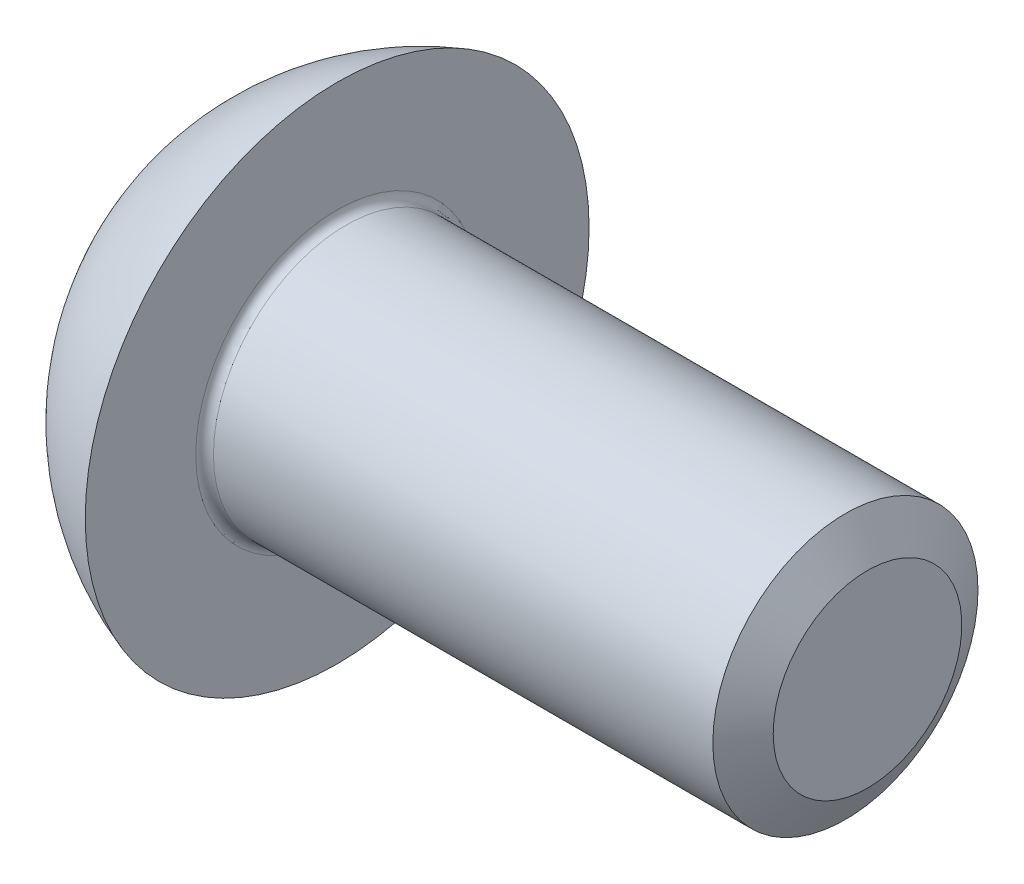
ISO-10303-21;
HEADER;
FILE_DESCRIPTION(('STEP AP214'),'2;1');
FILE_NAME('part.step','',(''),(''),'','','');
FILE_SCHEMA(('AUTOMOTIVE_DESIGN { 1 0 10303 214 1 1 1 1 }'));
ENDSEC;
DATA;
#1=APPLICATION_CONTEXT('core data for automotive mechanical design processes');
#2=APPLICATION_PROTOCOL_DEFINITION('international standard','automotive_design',2000,#1);
#3=PRODUCT_CONTEXT('',#1,'mechanical');
#4=PRODUCT('Part','Part','',(#3));
#5=PRODUCT_RELATED_PRODUCT_CATEGORY('part','',(#4));
#6=PRODUCT_DEFINITION_FORMATION('','',#4);
#7=PRODUCT_DEFINITION_CONTEXT('part definition',#1,'design');
#8=PRODUCT_DEFINITION('design','',#6,#7);
#9=PRODUCT_DEFINITION_SHAPE('','',#8);
#10=(LENGTH_UNIT() NAMED_UNIT(*) SI_UNIT(.MILLI.,.METRE.));
#11=(NAMED_UNIT(*) PLANE_ANGLE_UNIT() SI_UNIT($,.RADIAN.));
#12=(NAMED_UNIT(*) SI_UNIT($,.STERADIAN.) SOLID_ANGLE_UNIT());
#13=UNCERTAINTY_MEASURE_WITH_UNIT(LENGTH_MEASURE(1.E-05),#10,'distance_accuracy_value','');
#14=(GEOMETRIC_REPRESENTATION_CONTEXT(3) GLOBAL_UNCERTAINTY_ASSIGNED_CONTEXT((#13)) GLOBAL_UNIT_ASSIGNED_CONTEXT((#10,
#11,#12)) REPRESENTATION_CONTEXT('',''));
#15=CARTESIAN_POINT('',(0.,0.,0.));
#16=DIRECTION('',(0.,0.,1.));
#17=DIRECTION('',(1.,0.,0.));
#18=AXIS2_PLACEMENT_3D('',#15,#16,#17);
#19=CARTESIAN_POINT('',(-7.65,0.,0.));
#20=DIRECTION('',(-1.,0.,0.));
#21=DIRECTION('',(0.,0.,1.));
#22=AXIS2_PLACEMENT_3D('',#19,#20,#21);
#23=CYLINDRICAL_SURFACE('',#22,1.5);
#24=CARTESIAN_POINT('',(-5.9,0.,0.));
#25=DIRECTION('',(-1.,0.,0.));
#26=DIRECTION('',(0.,0.,1.));
#27=AXIS2_PLACEMENT_3D('',#24,#25,#26);
#28=CIRCLE('',#27,1.5);
#29=CARTESIAN_POINT('',(-5.9,0.,1.5));
#30=VERTEX_POINT('',#29);
#31=EDGE_CURVE('E251',#30,#30,#28,.T.);
#32=ORIENTED_EDGE('',*,*,#31,.F.);
#33=EDGE_LOOP('',(#32));
#34=FACE_BOUND('',#33,.T.);
#35=CARTESIAN_POINT('',(-0.25,0.,0.));
#36=DIRECTION('',(-1.,0.,0.));
#37=DIRECTION('',(0.,0.,1.));
#38=AXIS2_PLACEMENT_3D('',#35,#36,#37);
#39=CIRCLE('',#38,1.5);
#40=CARTESIAN_POINT('',(-0.25,0.,1.5));
#41=VERTEX_POINT('',#40);
#42=EDGE_CURVE('E435',#41,#41,#39,.T.);
#43=ORIENTED_EDGE('',*,*,#42,.T.);
#44=EDGE_LOOP('',(#43));
#45=FACE_BOUND('',#44,.T.);
#46=ADVANCED_FACE('F39',(#34,#45),#23,.T.);
#47=CARTESIAN_POINT('',(-7.65,0.,0.));
#48=DIRECTION('',(1.,0.,0.));
#49=DIRECTION('',(0.,0.,-1.));
#50=AXIS2_PLACEMENT_3D('',#47,#48,#49);
#51=PLANE('',#50);
#52=CARTESIAN_POINT('',(-7.65,0.,0.));
#53=DIRECTION('',(-1.,0.,0.));
#54=DIRECTION('',(0.,0.,1.));
#55=AXIS2_PLACEMENT_3D('',#52,#53,#54);
#56=CIRCLE('',#55,1.5);
#57=CARTESIAN_POINT('',(-7.65,1.5,0.));
#58=VERTEX_POINT('',#57);
#59=EDGE_CURVE('E243',#58,#58,#56,.T.);
#60=ORIENTED_EDGE('',*,*,#59,.T.);
#61=EDGE_LOOP('',(#60));
#62=FACE_BOUND('',#61,.T.);
#63=CARTESIAN_POINT('',(-7.65,0.,0.));
#64=DIRECTION('',(1.,0.,0.));
#65=DIRECTION('',(0.,0.,-1.));
#66=AXIS2_PLACEMENT_3D('',#63,#64,#65);
#67=CIRCLE('',#66,1.15470053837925);
#68=CARTESIAN_POINT('',(-7.65,-0.577350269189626,-1.));
#69=VERTEX_POINT('',#68);
#70=CARTESIAN_POINT('',(-7.65,-1.15470053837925,0.));
#71=VERTEX_POINT('',#70);
#72=EDGE_CURVE('E11',#69,#71,#67,.F.);
#73=ORIENTED_EDGE('',*,*,#72,.F.);
#74=CARTESIAN_POINT('',(-7.65,0.577350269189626,-1.));
#75=VERTEX_POINT('',#74);
#76=EDGE_CURVE('E43',#75,#69,#67,.F.);
#77=ORIENTED_EDGE('',*,*,#76,.F.);
#78=CARTESIAN_POINT('',(-7.65,1.15470053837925,0.));
#79=VERTEX_POINT('',#78);
#80=EDGE_CURVE('E112',#79,#75,#67,.F.);
#81=ORIENTED_EDGE('',*,*,#80,.F.);
#82=CARTESIAN_POINT('',(-7.65,0.,0.));
#83=DIRECTION('',(-1.,0.,0.));
#84=DIRECTION('',(0.,0.,1.));
#85=AXIS2_PLACEMENT_3D('',#82,#83,#84);
#86=CIRCLE('',#85,1.15470053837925);
#87=CARTESIAN_POINT('',(-7.65,0.577350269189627,1.));
#88=VERTEX_POINT('',#87);
#89=EDGE_CURVE('E132',#88,#79,#86,.T.);
#90=ORIENTED_EDGE('',*,*,#89,.F.);
#91=CARTESIAN_POINT('',(-7.65,-0.577350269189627,1.));
#92=VERTEX_POINT('',#91);
#93=EDGE_CURVE('E314',#92,#88,#67,.F.);
#94=ORIENTED_EDGE('',*,*,#93,.F.);
#95=EDGE_CURVE('E48',#71,#92,#67,.F.);
#96=ORIENTED_EDGE('',*,*,#95,.F.);
#97=EDGE_LOOP('',(#73,#77,#81,#90,#94,#96));
#98=FACE_BOUND('',#97,.T.);
#99=ADVANCED_FACE('F41',(#62,#98),#51,.F.);
#100=CARTESIAN_POINT('',(-5.04545454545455,0.,0.));
#101=DIRECTION('',(-1.,0.,0.));
#102=DIRECTION('',(0.,1.,0.));
#103=AXIS2_PLACEMENT_3D('',#100,#101,#102);
#104=SPHERICAL_SURFACE('',#103,3.00560426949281);
#105=CARTESIAN_POINT('',(-6.00000000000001,0.,0.));
#106=DIRECTION('',(-1.,0.,0.));
#107=DIRECTION('',(0.,0.,1.));
#108=AXIS2_PLACEMENT_3D('',#105,#106,#107);
#109=CIRCLE('',#108,2.85);
#110=CARTESIAN_POINT('',(-6.,2.85,0.));
#111=VERTEX_POINT('',#110);
#112=EDGE_CURVE('E246',#111,#111,#109,.T.);
#113=CARTESIAN_POINT('',(-7.65,1.5,0.));
#114=CARTESIAN_POINT('',(-7.6386705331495,1.51967216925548,0.));
#115=CARTESIAN_POINT('',(-7.62711811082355,1.53921593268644,0.));
#116=CARTESIAN_POINT('',(-7.60357346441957,1.57803672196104,0.));
#117=CARTESIAN_POINT('',(-7.59158124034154,1.59731374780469,0.));
#118=CARTESIAN_POINT('',(-7.56716309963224,1.6355911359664,0.));
#119=CARTESIAN_POINT('',(-7.55473718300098,1.65459149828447,0.));
#120=CARTESIAN_POINT('',(-7.52945804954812,1.69230581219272,0.));
#121=CARTESIAN_POINT('',(-7.51660483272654,1.7110197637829,0.));
#122=CARTESIAN_POINT('',(-7.49047769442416,1.74815164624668,0.));
#123=CARTESIAN_POINT('',(-7.47720377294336,1.76656957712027,0.));
#124=CARTESIAN_POINT('',(-7.45024204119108,1.80309996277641,0.));
#125=CARTESIAN_POINT('',(-7.43655423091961,1.82121241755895,0.));
#126=CARTESIAN_POINT('',(-7.40877174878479,1.85712255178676,0.));
#127=CARTESIAN_POINT('',(-7.39467707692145,1.87492023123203,0.));
#128=CARTESIAN_POINT('',(-7.36608810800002,1.91019167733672,0.));
#129=CARTESIAN_POINT('',(-7.35159381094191,1.92766544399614,0.));
#130=CARTESIAN_POINT('',(-7.32221303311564,1.96228009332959,0.));
#131=CARTESIAN_POINT('',(-7.30732655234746,1.97942097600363,0.));
#132=CARTESIAN_POINT('',(-7.27716904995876,2.013361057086,0.));
#133=CARTESIAN_POINT('',(-7.26189802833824,2.03016025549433,0.));
#134=CARTESIAN_POINT('',(-7.2309792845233,2.06340834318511,0.));
#135=CARTESIAN_POINT('',(-7.21533156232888,2.07985723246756,0.));
#136=CARTESIAN_POINT('',(-7.18366745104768,2.11239625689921,0.));
#137=CARTESIAN_POINT('',(-7.16765106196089,2.12848639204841,0.));
#138=CARTESIAN_POINT('',(-7.13525783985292,2.16029964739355,0.));
#139=CARTESIAN_POINT('',(-7.11888100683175,2.17602276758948,0.));
#140=CARTESIAN_POINT('',(-7.08577530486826,2.2070939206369,0.));
#141=CARTESIAN_POINT('',(-7.06904643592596,2.22244195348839,0.));
#142=CARTESIAN_POINT('',(-7.03524525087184,2.25275505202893,0.));
#143=CARTESIAN_POINT('',(-7.01817293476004,2.26772011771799,0.));
#144=CARTESIAN_POINT('',(-6.98369362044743,2.29725959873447,0.));
#145=CARTESIAN_POINT('',(-6.96628662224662,2.3118340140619,0.));
#146=CARTESIAN_POINT('',(-6.93114688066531,2.34058471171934,0.));
#147=CARTESIAN_POINT('',(-6.9134141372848,2.35476099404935,0.));
#148=CARTESIAN_POINT('',(-6.87763200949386,2.38270814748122,0.));
#149=CARTESIAN_POINT('',(-6.85958262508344,2.39647901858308,0.));
#150=CARTESIAN_POINT('',(-6.82317648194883,2.42360827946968,0.));
#151=CARTESIAN_POINT('',(-6.80481972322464,2.43696666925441,0.));
#152=CARTESIAN_POINT('',(-6.76780825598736,2.46326410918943,0.));
#153=CARTESIAN_POINT('',(-6.74915354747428,2.4762031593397,0.));
#154=CARTESIAN_POINT('',(-6.71155575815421,2.50165527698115,0.));
#155=CARTESIAN_POINT('',(-6.69261267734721,2.51416834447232,0.));
#156=CARTESIAN_POINT('',(-6.65444786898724,2.53876207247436,0.));
#157=CARTESIAN_POINT('',(-6.63522614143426,2.55084273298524,0.));
#158=CARTESIAN_POINT('',(-6.59651390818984,2.57456544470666,0.));
#159=CARTESIAN_POINT('',(-6.5770234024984,2.5862074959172,0.));
#160=CARTESIAN_POINT('',(-6.53778361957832,2.60904701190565,0.));
#161=CARTESIAN_POINT('',(-6.51803434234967,2.62024447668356,0.));
#162=CARTESIAN_POINT('',(-6.4782871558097,2.6421890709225,0.));
#163=CARTESIAN_POINT('',(-6.45828924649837,2.65293620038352,0.));
#164=CARTESIAN_POINT('',(-6.41805506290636,2.67397460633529,0.));
#165=CARTESIAN_POINT('',(-6.39781878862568,2.68426588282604,0.));
#166=CARTESIAN_POINT('',(-6.3571182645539,2.70438729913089,0.));
#167=CARTESIAN_POINT('',(-6.3366540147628,2.714217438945,0.));
#168=CARTESIAN_POINT('',(-6.29550804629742,2.73341153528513,0.));
#169=CARTESIAN_POINT('',(-6.27482632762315,2.74277549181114,0.));
#170=CARTESIAN_POINT('',(-6.23325603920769,2.7610324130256,0.));
#171=CARTESIAN_POINT('',(-6.2123674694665,2.76992537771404,0.));
#172=CARTESIAN_POINT('',(-6.17039420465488,2.78723575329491,0.));
#173=CARTESIAN_POINT('',(-6.14930950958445,2.79565316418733,0.));
#174=CARTESIAN_POINT('',(-6.10695481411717,2.81200809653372,0.));
#175=CARTESIAN_POINT('',(-6.08568481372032,2.8199456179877,0.));
#176=CARTESIAN_POINT('',(-6.04297044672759,2.83533674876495,0.));
#177=CARTESIAN_POINT('',(-6.02152608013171,2.84279035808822,0.));
#178=CARTESIAN_POINT('',(-6.,2.85,0.));
#179=B_SPLINE_CURVE_WITH_KNOTS('',3,(#113,#114,#115,#116,#117,#118,#119,#120,#121,#122,#123,
#124,#125,#126,#127,#128,#129,#130,#131,#132,#133,#134,#135,#136,#137,#138,#139,#140,#141,#142,
#143,#144,#145,#146,#147,#148,#149,#150,#151,#152,#153,#154,#155,#156,#157,#158,#159,#160,#161,
#162,#163,#164,#165,#166,#167,#168,#169,#170,#171,#172,#173,#174,#175,#176,#177,#178),
.UNSPECIFIED.,.F.,.F.,(4,2,2,2,2,2,2,2,2,2,2,2,2,2,2,2,2,2,2,2,2,2,2,2,2,2,2,2,2,2,2,2,4),(0.,
0.0681025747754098,0.136205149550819,0.204307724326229,0.272410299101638,0.340512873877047,
0.408615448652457,0.476718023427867,0.544820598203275,0.612923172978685,0.681025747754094,
0.749128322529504,0.817230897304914,0.885333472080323,0.953436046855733,1.02153862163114,
1.08964119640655,1.15774377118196,1.22584634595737,1.29394892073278,1.36205149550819,
1.4301540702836,1.49825664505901,1.56635921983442,1.63446179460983,1.70256436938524,
1.77066694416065,1.83876951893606,1.90687209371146,1.97497466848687,2.04307724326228,
2.11117981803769,2.1792823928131),.UNSPECIFIED.);
#180=EDGE_CURVE('BSEAM232',#58,#111,#179,.T.);
#181=ORIENTED_EDGE('',*,*,#59,.F.);
#182=ORIENTED_EDGE('',*,*,#112,.T.);
#183=ORIENTED_EDGE('',*,*,#180,.T.);
#184=ORIENTED_EDGE('',*,*,#180,.F.);
#185=EDGE_LOOP('',(#181,#183,#182,#184));
#186=FACE_BOUND('',#185,.T.);
#187=ADVANCED_FACE('F232',(#186),#104,.T.);
#188=CARTESIAN_POINT('',(-6.,1.6,0.));
#189=DIRECTION('',(-1.,0.,0.));
#190=DIRECTION('',(0.,0.,1.));
#191=AXIS2_PLACEMENT_3D('',#188,#189,#190);
#192=PLANE('',#191);
#193=ORIENTED_EDGE('',*,*,#112,.F.);
#194=EDGE_LOOP('',(#193));
#195=FACE_BOUND('',#194,.T.);
#196=CARTESIAN_POINT('',(-6.,0.,0.));
#197=DIRECTION('',(-1.,0.,0.));
#198=DIRECTION('',(0.,0.,1.));
#199=AXIS2_PLACEMENT_3D('',#196,#197,#198);
#200=CIRCLE('',#199,1.6);
#201=CARTESIAN_POINT('',(-6.,0.,1.6));
#202=VERTEX_POINT('',#201);
#203=EDGE_CURVE('E247',#202,#202,#200,.T.);
#204=ORIENTED_EDGE('',*,*,#203,.T.);
#205=EDGE_LOOP('',(#204));
#206=FACE_BOUND('',#205,.T.);
#207=ADVANCED_FACE('F229',(#195,#206),#192,.F.);
#208=CARTESIAN_POINT('',(-5.9,0.,0.));
#209=DIRECTION('',(-1.,0.,0.));
#210=DIRECTION('',(0.,0.,1.));
#211=AXIS2_PLACEMENT_3D('',#208,#209,#210);
#212=TOROIDAL_SURFACE('',#211,1.6,0.0999999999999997);
#213=ORIENTED_EDGE('',*,*,#203,.F.);
#214=EDGE_LOOP('',(#213));
#215=FACE_BOUND('',#214,.T.);
#216=ORIENTED_EDGE('',*,*,#31,.T.);
#217=EDGE_LOOP('',(#216));
#218=FACE_BOUND('',#217,.T.);
#219=ADVANCED_FACE('F226',(#215,#218),#212,.F.);
#220=CARTESIAN_POINT('',(-7.35,0.,0.));
#221=DIRECTION('',(-1.,0.,0.));
#222=DIRECTION('',(0.,0.,1.));
#223=AXIS2_PLACEMENT_3D('',#220,#221,#222);
#224=CONICAL_SURFACE('',#223,0.,1.31660847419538);
#225=CARTESIAN_POINT('',(-7.82013380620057,-1.50813004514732,-1.));
#226=CARTESIAN_POINT('',(-7.8103550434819,-1.46296169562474,-1.));
#227=CARTESIAN_POINT('',(-7.80070106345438,-1.41776633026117,-1.));
#228=CARTESIAN_POINT('',(-7.78170572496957,-1.32730802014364,-1.));
#229=CARTESIAN_POINT('',(-7.77236437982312,-1.28204507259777,-1.));
#230=CARTESIAN_POINT('',(-7.74488770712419,-1.14605409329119,-1.));
#231=CARTESIAN_POINT('',(-7.72731859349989,-1.05520983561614,-1.));
#232=CARTESIAN_POINT('',(-7.69461131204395,-0.873838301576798,-1.));
#233=CARTESIAN_POINT('',(-7.67945456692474,-0.7833144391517,-1.));
#234=CARTESIAN_POINT('',(-7.6526000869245,-0.6017545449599,-1.));
#235=CARTESIAN_POINT('',(-7.64090169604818,-0.510718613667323,-1.));
#236=CARTESIAN_POINT('',(-7.62246881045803,-0.327147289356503,-1.));
#237=CARTESIAN_POINT('',(-7.61578776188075,-0.234606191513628,-1.));
#238=CARTESIAN_POINT('',(-7.60903683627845,-0.0493046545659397,-1.));
#239=CARTESIAN_POINT('',(-7.60896400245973,0.0434556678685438,-1.));
#240=CARTESIAN_POINT('',(-7.61545349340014,0.229083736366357,-1.));
#241=CARTESIAN_POINT('',(-7.62204147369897,0.321950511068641,-1.));
#242=CARTESIAN_POINT('',(-7.64045721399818,0.507192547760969,-1.));
#243=CARTESIAN_POINT('',(-7.65228848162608,0.599567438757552,-1.));
#244=CARTESIAN_POINT('',(-7.67981183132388,0.785811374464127,-1.));
#245=CARTESIAN_POINT('',(-7.69558360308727,0.879668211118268,-1.));
#246=CARTESIAN_POINT('',(-7.72952329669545,1.06695285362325,-1.));
#247=CARTESIAN_POINT('',(-7.74769157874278,1.1603805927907,-1.));
#248=CARTESIAN_POINT('',(-7.78558531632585,1.34694314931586,-1.));
#249=CARTESIAN_POINT('',(-7.80531120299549,1.44007787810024,-1.));
#250=CARTESIAN_POINT('',(-7.84579713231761,1.62612272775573,-1.));
#251=CARTESIAN_POINT('',(-7.86655719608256,1.71903284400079,-1.));
#252=CARTESIAN_POINT('',(-7.90854857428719,1.903637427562,-1.));
#253=CARTESIAN_POINT('',(-7.92977186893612,1.9953337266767,-1.));
#254=CARTESIAN_POINT('',(-7.97271430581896,2.17861191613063,-1.));
#255=CARTESIAN_POINT('',(-7.99443345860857,2.27019380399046,-1.));
#256=CARTESIAN_POINT('',(-8.03820424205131,2.45314970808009,-1.));
#257=CARTESIAN_POINT('',(-8.06025539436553,2.5445238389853,-1.));
#258=CARTESIAN_POINT('',(-8.10463324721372,2.72720190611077,-1.));
#259=CARTESIAN_POINT('',(-8.12695993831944,2.8185058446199,-1.));
#260=CARTESIAN_POINT('',(-8.14938266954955,2.90978592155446,-1.));
#261=B_SPLINE_CURVE_WITH_KNOTS('',3,(#225,#226,#227,#228,#229,#230,#231,#232,#233,#234,#235,
#236,#237,#238,#239,#240,#241,#242,#243,#244,#245,#246,#247,#248,#249,#250,#251,#252,#253,#254,
#255,#256,#257,#258,#259,#260),.UNSPECIFIED.,.F.,.F.,(4,2,2,2,2,2,2,2,2,2,2,2,2,2,2,2,2,4),(0.,
0.138643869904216,0.27729363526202,0.554857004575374,0.830167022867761,1.1054247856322,
1.38357462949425,1.66160001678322,1.94070037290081,2.2199877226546,2.50545939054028,
2.79097401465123,3.07656794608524,3.36216771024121,3.64452690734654,3.92689212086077,
4.20888343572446,4.49086512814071),.UNSPECIFIED.);
#262=EDGE_CURVE('E103',#69,#75,#261,.T.);
#263=ORIENTED_EDGE('',*,*,#262,.T.);
#264=ORIENTED_EDGE('',*,*,#76,.T.);
#265=EDGE_LOOP('',(#263,#264));
#266=FACE_BOUND('',#265,.T.);
#267=ADVANCED_FACE('F107',(#266),#224,.F.);
#268=CARTESIAN_POINT('',(-7.65003000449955,0.577234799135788,-1.0002));
#269=CARTESIAN_POINT('',(-7.64379291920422,0.6012250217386,-0.958647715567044));
#270=CARTESIAN_POINT('',(-7.63813137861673,0.625256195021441,-0.917024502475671));
#271=CARTESIAN_POINT('',(-7.62818542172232,0.673398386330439,-0.833639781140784));
#272=CARTESIAN_POINT('',(-7.6239015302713,0.697509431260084,-0.791878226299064));
#273=CARTESIAN_POINT('',(-7.61695890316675,0.745673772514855,-0.708455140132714));
#274=CARTESIAN_POINT('',(-7.6142923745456,0.769726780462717,-0.666794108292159));
#275=CARTESIAN_POINT('',(-7.61071689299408,0.817861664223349,-0.583422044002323));
#276=CARTESIAN_POINT('',(-7.60980762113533,0.841943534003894,-0.541711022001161));
#277=CARTESIAN_POINT('',(-7.60980762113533,0.890107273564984,-0.458288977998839));
#278=CARTESIAN_POINT('',(-7.61071689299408,0.914189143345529,-0.416577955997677));
#279=CARTESIAN_POINT('',(-7.6142923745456,0.962324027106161,-0.333205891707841));
#280=CARTESIAN_POINT('',(-7.61695890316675,0.986377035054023,-0.291544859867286));
#281=CARTESIAN_POINT('',(-7.6239015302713,1.03454137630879,-0.208121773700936));
#282=CARTESIAN_POINT('',(-7.62818542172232,1.05865242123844,-0.166360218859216));
#283=CARTESIAN_POINT('',(-7.63813137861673,1.10679461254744,-0.0829754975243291));
#284=CARTESIAN_POINT('',(-7.64379291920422,1.13082578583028,-0.0413522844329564));
#285=CARTESIAN_POINT('',(-7.65003000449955,1.15481600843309,0.000199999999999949));
#286=B_SPLINE_CURVE_WITH_KNOTS('',3,(#268,#269,#270,#271,#272,#273,#274,#275,#276,#277,#278,
#279,#280,#281,#282,#283,#284,#285),.UNSPECIFIED.,.F.,.F.,(4,2,2,2,2,2,2,2,4),(0.,
0.145159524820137,0.290374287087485,0.434883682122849,0.57936684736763,0.723850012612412,
0.868359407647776,1.01357416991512,1.15873369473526),.UNSPECIFIED.);
#287=EDGE_CURVE('E130',#75,#79,#286,.T.);
#288=ORIENTED_EDGE('',*,*,#287,.T.);
#289=ORIENTED_EDGE('',*,*,#80,.T.);
#290=EDGE_LOOP('',(#288,#289));
#291=FACE_BOUND('',#290,.T.);
#292=ADVANCED_FACE('F156',(#291),#224,.F.);
#293=CARTESIAN_POINT('',(-7.65003000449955,1.15481600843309,-0.000199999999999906));
#294=CARTESIAN_POINT('',(-7.64379291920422,1.13082578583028,0.0413522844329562));
#295=CARTESIAN_POINT('',(-7.63813137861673,1.10679461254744,0.0829754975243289));
#296=CARTESIAN_POINT('',(-7.62818542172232,1.05865242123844,0.166360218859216));
#297=CARTESIAN_POINT('',(-7.6239015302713,1.03454137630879,0.208121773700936));
#298=CARTESIAN_POINT('',(-7.61695890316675,0.986377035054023,0.291544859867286));
#299=CARTESIAN_POINT('',(-7.6142923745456,0.962324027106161,0.333205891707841));
#300=CARTESIAN_POINT('',(-7.61071689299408,0.914189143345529,0.416577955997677));
#301=CARTESIAN_POINT('',(-7.60980762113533,0.890107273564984,0.458288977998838));
#302=CARTESIAN_POINT('',(-7.60980762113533,0.841943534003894,0.541711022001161));
#303=CARTESIAN_POINT('',(-7.61071689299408,0.817861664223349,0.583422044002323));
#304=CARTESIAN_POINT('',(-7.6142923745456,0.769726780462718,0.666794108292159));
#305=CARTESIAN_POINT('',(-7.61695890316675,0.745673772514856,0.708455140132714));
#306=CARTESIAN_POINT('',(-7.6239015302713,0.697509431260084,0.791878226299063));
#307=CARTESIAN_POINT('',(-7.62818542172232,0.67339838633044,0.833639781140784));
#308=CARTESIAN_POINT('',(-7.63813137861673,0.625256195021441,0.917024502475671));
#309=CARTESIAN_POINT('',(-7.64379291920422,0.6012250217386,0.958647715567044));
#310=CARTESIAN_POINT('',(-7.65003000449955,0.577234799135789,1.0002));
#311=B_SPLINE_CURVE_WITH_KNOTS('',3,(#293,#294,#295,#296,#297,#298,#299,#300,#301,#302,#303,
#304,#305,#306,#307,#308,#309,#310),.UNSPECIFIED.,.F.,.F.,(4,2,2,2,2,2,2,2,4),(0.,
0.145159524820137,0.290374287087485,0.434883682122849,0.57936684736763,0.723850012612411,
0.868359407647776,1.01357416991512,1.15873369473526),.UNSPECIFIED.);
#312=EDGE_CURVE('E176',#79,#88,#311,.T.);
#313=ORIENTED_EDGE('',*,*,#312,.T.);
#314=ORIENTED_EDGE('',*,*,#89,.T.);
#315=EDGE_LOOP('',(#313,#314));
#316=FACE_BOUND('',#315,.T.);
#317=ADVANCED_FACE('F150',(#316),#224,.F.);
#318=CARTESIAN_POINT('',(-7.82013380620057,-1.50813004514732,1.));
#319=CARTESIAN_POINT('',(-7.8103550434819,-1.46296169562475,1.));
#320=CARTESIAN_POINT('',(-7.80070106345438,-1.41776633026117,1.));
#321=CARTESIAN_POINT('',(-7.78170572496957,-1.32730802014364,1.));
#322=CARTESIAN_POINT('',(-7.77236437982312,-1.28204507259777,1.));
#323=CARTESIAN_POINT('',(-7.74488770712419,-1.14605409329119,1.));
#324=CARTESIAN_POINT('',(-7.72731859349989,-1.05520983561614,1.));
#325=CARTESIAN_POINT('',(-7.69461131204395,-0.873838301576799,1.));
#326=CARTESIAN_POINT('',(-7.67945456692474,-0.783314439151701,1.));
#327=CARTESIAN_POINT('',(-7.6526000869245,-0.601754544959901,1.));
#328=CARTESIAN_POINT('',(-7.64090169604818,-0.510718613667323,1.));
#329=CARTESIAN_POINT('',(-7.62246881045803,-0.327147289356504,1.));
#330=CARTESIAN_POINT('',(-7.61578776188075,-0.234606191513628,1.));
#331=CARTESIAN_POINT('',(-7.60903683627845,-0.0493046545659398,1.));
#332=CARTESIAN_POINT('',(-7.60896400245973,0.0434556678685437,1.));
#333=CARTESIAN_POINT('',(-7.61545349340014,0.229083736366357,1.));
#334=CARTESIAN_POINT('',(-7.62204147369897,0.321950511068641,1.));
#335=CARTESIAN_POINT('',(-7.64045721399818,0.507192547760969,1.));
#336=CARTESIAN_POINT('',(-7.65228848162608,0.599567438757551,1.));
#337=CARTESIAN_POINT('',(-7.67981183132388,0.785811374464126,1.));
#338=CARTESIAN_POINT('',(-7.69558360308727,0.879668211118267,1.));
#339=CARTESIAN_POINT('',(-7.72952329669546,1.06695285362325,1.));
#340=CARTESIAN_POINT('',(-7.74769157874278,1.1603805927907,0.999999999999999));
#341=CARTESIAN_POINT('',(-7.78558531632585,1.34694314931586,0.999999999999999));
#342=CARTESIAN_POINT('',(-7.80531120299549,1.44007787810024,0.999999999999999));
#343=CARTESIAN_POINT('',(-7.84579713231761,1.62612272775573,0.999999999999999));
#344=CARTESIAN_POINT('',(-7.86655719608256,1.71903284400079,0.999999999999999));
#345=CARTESIAN_POINT('',(-7.90854857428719,1.903637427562,0.999999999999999));
#346=CARTESIAN_POINT('',(-7.92977186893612,1.9953337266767,0.999999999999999));
#347=CARTESIAN_POINT('',(-7.97271430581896,2.17861191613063,0.999999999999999));
#348=CARTESIAN_POINT('',(-7.99443345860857,2.27019380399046,0.999999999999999));
#349=CARTESIAN_POINT('',(-8.03820424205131,2.45314970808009,0.999999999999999));
#350=CARTESIAN_POINT('',(-8.06025539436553,2.5445238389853,0.999999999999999));
#351=CARTESIAN_POINT('',(-8.10463324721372,2.72720190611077,0.999999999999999));
#352=CARTESIAN_POINT('',(-8.12695993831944,2.81850584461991,0.999999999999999));
#353=CARTESIAN_POINT('',(-8.14938266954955,2.90978592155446,0.999999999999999));
#354=B_SPLINE_CURVE_WITH_KNOTS('',3,(#318,#319,#320,#321,#322,#323,#324,#325,#326,#327,#328,
#329,#330,#331,#332,#333,#334,#335,#336,#337,#338,#339,#340,#341,#342,#343,#344,#345,#346,#347,
#348,#349,#350,#351,#352,#353),.UNSPECIFIED.,.F.,.F.,(4,2,2,2,2,2,2,2,2,2,2,2,2,2,2,2,2,4),(0.,
0.138643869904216,0.27729363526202,0.554857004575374,0.83016702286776,1.1054247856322,
1.38357462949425,1.66160001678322,1.94070037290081,2.2199877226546,2.50545939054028,
2.79097401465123,3.07656794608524,3.36216771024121,3.64452690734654,3.92689212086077,
4.20888343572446,4.49086512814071),.UNSPECIFIED.);
#355=EDGE_CURVE('E60',#88,#92,#354,.F.);
#356=ORIENTED_EDGE('',*,*,#355,.T.);
#357=ORIENTED_EDGE('',*,*,#93,.T.);
#358=EDGE_LOOP('',(#356,#357));
#359=FACE_BOUND('',#358,.T.);
#360=ADVANCED_FACE('F155',(#359),#224,.F.);
#361=CARTESIAN_POINT('',(-7.65003000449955,-0.577234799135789,1.0002));
#362=CARTESIAN_POINT('',(-7.64379291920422,-0.6012250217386,0.958647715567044));
#363=CARTESIAN_POINT('',(-7.63813137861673,-0.625256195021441,0.917024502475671));
#364=CARTESIAN_POINT('',(-7.62818542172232,-0.67339838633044,0.833639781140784));
#365=CARTESIAN_POINT('',(-7.6239015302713,-0.697509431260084,0.791878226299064));
#366=CARTESIAN_POINT('',(-7.61695890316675,-0.745673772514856,0.708455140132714));
#367=CARTESIAN_POINT('',(-7.6142923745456,-0.769726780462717,0.666794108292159));
#368=CARTESIAN_POINT('',(-7.61071689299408,-0.817861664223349,0.583422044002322));
#369=CARTESIAN_POINT('',(-7.60980762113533,-0.841943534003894,0.541711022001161));
#370=CARTESIAN_POINT('',(-7.60980762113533,-0.890107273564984,0.458288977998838));
#371=CARTESIAN_POINT('',(-7.61071689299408,-0.914189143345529,0.416577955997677));
#372=CARTESIAN_POINT('',(-7.6142923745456,-0.962324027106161,0.333205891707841));
#373=CARTESIAN_POINT('',(-7.61695890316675,-0.986377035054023,0.291544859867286));
#374=CARTESIAN_POINT('',(-7.6239015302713,-1.03454137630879,0.208121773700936));
#375=CARTESIAN_POINT('',(-7.62818542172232,-1.05865242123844,0.166360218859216));
#376=CARTESIAN_POINT('',(-7.63813137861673,-1.10679461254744,0.0829754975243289));
#377=CARTESIAN_POINT('',(-7.64379291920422,-1.13082578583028,0.0413522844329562));
#378=CARTESIAN_POINT('',(-7.65003000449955,-1.15481600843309,-0.000200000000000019));
#379=B_SPLINE_CURVE_WITH_KNOTS('',3,(#361,#362,#363,#364,#365,#366,#367,#368,#369,#370,#371,
#372,#373,#374,#375,#376,#377,#378),.UNSPECIFIED.,.F.,.F.,(4,2,2,2,2,2,2,2,4),(0.,
0.145159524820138,0.290374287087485,0.43488368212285,0.579366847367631,0.723850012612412,
0.868359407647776,1.01357416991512,1.15873369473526),.UNSPECIFIED.);
#380=EDGE_CURVE('E54',#92,#71,#379,.T.);
#381=ORIENTED_EDGE('',*,*,#380,.T.);
#382=ORIENTED_EDGE('',*,*,#95,.T.);
#383=EDGE_LOOP('',(#381,#382));
#384=FACE_BOUND('',#383,.T.);
#385=ADVANCED_FACE('F300',(#384),#224,.F.);
#386=CARTESIAN_POINT('',(-7.65003000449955,-1.15481600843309,0.000199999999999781));
#387=CARTESIAN_POINT('',(-7.64379291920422,-1.13082578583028,-0.0413522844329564));
#388=CARTESIAN_POINT('',(-7.63813137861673,-1.10679461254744,-0.0829754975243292));
#389=CARTESIAN_POINT('',(-7.62818542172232,-1.05865242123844,-0.166360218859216));
#390=CARTESIAN_POINT('',(-7.6239015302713,-1.03454137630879,-0.208121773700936));
#391=CARTESIAN_POINT('',(-7.61695890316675,-0.986377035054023,-0.291544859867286));
#392=CARTESIAN_POINT('',(-7.6142923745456,-0.962324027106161,-0.333205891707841));
#393=CARTESIAN_POINT('',(-7.61071689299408,-0.914189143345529,-0.416577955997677));
#394=CARTESIAN_POINT('',(-7.60980762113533,-0.890107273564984,-0.458288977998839));
#395=CARTESIAN_POINT('',(-7.60980762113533,-0.841943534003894,-0.541711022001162));
#396=CARTESIAN_POINT('',(-7.61071689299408,-0.817861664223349,-0.583422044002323));
#397=CARTESIAN_POINT('',(-7.6142923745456,-0.769726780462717,-0.66679410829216));
#398=CARTESIAN_POINT('',(-7.61695890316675,-0.745673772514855,-0.708455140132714));
#399=CARTESIAN_POINT('',(-7.6239015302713,-0.697509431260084,-0.791878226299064));
#400=CARTESIAN_POINT('',(-7.62818542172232,-0.673398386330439,-0.833639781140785));
#401=CARTESIAN_POINT('',(-7.63813137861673,-0.62525619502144,-0.917024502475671));
#402=CARTESIAN_POINT('',(-7.64379291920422,-0.601225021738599,-0.958647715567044));
#403=CARTESIAN_POINT('',(-7.65003000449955,-0.577234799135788,-1.0002));
#404=B_SPLINE_CURVE_WITH_KNOTS('',3,(#386,#387,#388,#389,#390,#391,#392,#393,#394,#395,#396,
#397,#398,#399,#400,#401,#402,#403),.UNSPECIFIED.,.F.,.F.,(4,2,2,2,2,2,2,2,4),(0.,
0.145159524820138,0.290374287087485,0.43488368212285,0.579366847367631,0.723850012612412,
0.868359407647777,1.01357416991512,1.15873369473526),.UNSPECIFIED.);
#405=EDGE_CURVE('E95',#71,#69,#404,.T.);
#406=ORIENTED_EDGE('',*,*,#405,.T.);
#407=ORIENTED_EDGE('',*,*,#72,.T.);
#408=EDGE_LOOP('',(#406,#407));
#409=FACE_BOUND('',#408,.T.);
#410=ADVANCED_FACE('F97',(#409),#224,.F.);
#411=CARTESIAN_POINT('',(-6.61,0.,0.));
#412=DIRECTION('',(-1.,0.,0.));
#413=DIRECTION('',(0.,0.,1.));
#414=AXIS2_PLACEMENT_3D('',#411,#412,#413);
#415=CONICAL_SURFACE('',#414,1.15470053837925,1.08478502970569);
#416=CARTESIAN_POINT('',(-6.00000000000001,0.,0.));
#417=VERTEX_POINT('',#416);
#418=VERTEX_LOOP('',#417);
#419=FACE_BOUND('',#418,.T.);
#420=CARTESIAN_POINT('',(-6.95337776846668,-1.50230992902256,1.));
#421=CARTESIAN_POINT('',(-6.93404447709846,-1.45833854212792,1.));
#422=CARTESIAN_POINT('',(-6.91492324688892,-1.41427434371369,1.));
#423=CARTESIAN_POINT('',(-6.87721630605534,-1.32590919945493,1.));
#424=CARTESIAN_POINT('',(-6.85863068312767,-1.28160821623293,1.));
#425=CARTESIAN_POINT('',(-6.80366814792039,-1.14784319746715,1.));
#426=CARTESIAN_POINT('',(-6.76828448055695,-1.0579632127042,1.));
#427=CARTESIAN_POINT('',(-6.7014887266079,-0.876123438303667,1.));
#428=CARTESIAN_POINT('',(-6.67010099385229,-0.784154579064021,1.));
#429=CARTESIAN_POINT('',(-6.61426989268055,-0.598229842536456,1.));
#430=CARTESIAN_POINT('',(-6.58981126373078,-0.504278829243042,1.));
#431=CARTESIAN_POINT('',(-6.56128421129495,-0.361662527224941,1.));
#432=CARTESIAN_POINT('',(-6.55313365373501,-0.313821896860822,1.));
#433=CARTESIAN_POINT('',(-6.54009013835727,-0.217683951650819,1.));
#434=CARTESIAN_POINT('',(-6.53519738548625,-0.169386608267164,1.));
#435=CARTESIAN_POINT('',(-6.52906892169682,-0.0727543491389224,1.));
#436=CARTESIAN_POINT('',(-6.52781819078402,-0.024420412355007,1.));
#437=CARTESIAN_POINT('',(-6.52903404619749,0.0721832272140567,1.));
#438=CARTESIAN_POINT('',(-6.53149961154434,0.120452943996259,1.));
#439=CARTESIAN_POINT('',(-6.54268581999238,0.247728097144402,1.));
#440=CARTESIAN_POINT('',(-6.55441562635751,0.326472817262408,1.));
#441=CARTESIAN_POINT('',(-6.5853155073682,0.48261102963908,1.));
#442=CARTESIAN_POINT('',(-6.60450541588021,0.560000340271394,1.));
#443=CARTESIAN_POINT('',(-6.64844209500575,0.714868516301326,1.));
#444=CARTESIAN_POINT('',(-6.67329514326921,0.792316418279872,1.));
#445=CARTESIAN_POINT('',(-6.71314935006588,0.907307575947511,1.));
#446=CARTESIAN_POINT('',(-6.72681730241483,0.94532619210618,1.));
#447=CARTESIAN_POINT('',(-6.75487650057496,1.02108213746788,1.));
#448=CARTESIAN_POINT('',(-6.76926751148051,1.05881955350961,1.));
#449=CARTESIAN_POINT('',(-6.78394894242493,1.09644387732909,1.));
#450=B_SPLINE_CURVE_WITH_KNOTS('',3,(#420,#421,#422,#423,#424,#425,#426,#427,#428,#429,#430,
#431,#432,#433,#434,#435,#436,#437,#438,#439,#440,#441,#442,#443,#444,#445,#446,#447,#448,#449),
.UNSPECIFIED.,.F.,.F.,(4,2,2,2,2,2,2,2,2,2,2,2,2,2,4),(0.,0.144099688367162,0.288222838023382,
0.577934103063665,0.869334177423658,1.16008739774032,1.30558498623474,1.45109172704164,
1.59599753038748,1.74086353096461,1.97918577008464,2.21814600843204,2.46202630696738,
2.58322416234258,2.70438289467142),.UNSPECIFIED.);
#451=CARTESIAN_POINT('',(-6.61,-0.577350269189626,1.));
#452=VERTEX_POINT('',#451);
#453=CARTESIAN_POINT('',(-6.61,0.577350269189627,1.));
#454=VERTEX_POINT('',#453);
#455=EDGE_CURVE('E191',#452,#454,#450,.T.);
#456=ORIENTED_EDGE('',*,*,#455,.T.);
#457=CARTESIAN_POINT('',(-6.61006100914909,0.577234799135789,1.0002));
#458=CARTESIAN_POINT('',(-6.59674716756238,0.602421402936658,0.956575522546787));
#459=CARTESIAN_POINT('',(-6.58464843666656,0.627789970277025,0.912635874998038));
#460=CARTESIAN_POINT('',(-6.56351592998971,0.678892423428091,0.824123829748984));
#461=CARTESIAN_POINT('',(-6.55448814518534,0.704626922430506,0.77955036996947));
#462=CARTESIAN_POINT('',(-6.54033689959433,0.755829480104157,0.690864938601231));
#463=CARTESIAN_POINT('',(-6.53513654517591,0.781292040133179,0.646762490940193));
#464=CARTESIAN_POINT('',(-6.52879891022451,0.8323219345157,0.558376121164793));
#465=CARTESIAN_POINT('',(-6.52765764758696,0.85788914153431,0.514092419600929));
#466=CARTESIAN_POINT('',(-6.52942932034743,0.906140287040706,0.430518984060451));
#467=CARTESIAN_POINT('',(-6.53190541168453,0.92882859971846,0.391221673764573));
#468=CARTESIAN_POINT('',(-6.53995672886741,0.974082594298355,0.312839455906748));
#469=CARTESIAN_POINT('',(-6.54553433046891,0.996648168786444,0.273754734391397));
#470=CARTESIAN_POINT('',(-6.55955566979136,1.04198502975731,0.195228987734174));
#471=CARTESIAN_POINT('',(-6.56805139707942,1.06475218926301,0.155795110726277));
#472=CARTESIAN_POINT('',(-6.58740312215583,1.1099976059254,0.0774277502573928));
#473=CARTESIAN_POINT('',(-6.59825526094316,1.13247627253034,0.0384935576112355));
#474=CARTESIAN_POINT('',(-6.61006100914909,1.15481600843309,-0.000199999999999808));
#475=B_SPLINE_CURVE_WITH_KNOTS('',3,(#457,#458,#459,#460,#461,#462,#463,#464,#465,#466,#467,
#468,#469,#470,#471,#472,#473,#474),.UNSPECIFIED.,.F.,.F.,(4,2,2,2,2,2,2,2,4),(0.,
0.156356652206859,0.313016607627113,0.466436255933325,0.619705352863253,0.755925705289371,
0.892250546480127,1.03114227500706,1.16980823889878),.UNSPECIFIED.);
#476=CARTESIAN_POINT('',(-6.61,1.15470053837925,0.));
#477=VERTEX_POINT('',#476);
#478=EDGE_CURVE('E198',#454,#477,#475,.T.);
#479=ORIENTED_EDGE('',*,*,#478,.T.);
#480=CARTESIAN_POINT('',(-6.61006100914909,1.15481600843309,0.000200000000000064));
#481=CARTESIAN_POINT('',(-6.59674716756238,1.12962940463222,-0.0434244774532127));
#482=CARTESIAN_POINT('',(-6.58464843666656,1.10426083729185,-0.0873641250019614));
#483=CARTESIAN_POINT('',(-6.56351592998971,1.05315838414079,-0.175876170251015));
#484=CARTESIAN_POINT('',(-6.55448814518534,1.02742388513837,-0.220449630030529));
#485=CARTESIAN_POINT('',(-6.54033689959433,0.976221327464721,-0.309135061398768));
#486=CARTESIAN_POINT('',(-6.53513654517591,0.9507587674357,-0.353237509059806));
#487=CARTESIAN_POINT('',(-6.52879891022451,0.899728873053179,-0.441623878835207));
#488=CARTESIAN_POINT('',(-6.52765764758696,0.874161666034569,-0.485907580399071));
#489=CARTESIAN_POINT('',(-6.52942932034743,0.825910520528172,-0.569481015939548));
#490=CARTESIAN_POINT('',(-6.53190541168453,0.803222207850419,-0.608778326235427));
#491=CARTESIAN_POINT('',(-6.53995672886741,0.757968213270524,-0.687160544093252));
#492=CARTESIAN_POINT('',(-6.54553433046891,0.735402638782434,-0.726245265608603));
#493=CARTESIAN_POINT('',(-6.55955566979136,0.69006577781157,-0.804771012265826));
#494=CARTESIAN_POINT('',(-6.56805139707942,0.66729861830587,-0.844204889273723));
#495=CARTESIAN_POINT('',(-6.58740312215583,0.622053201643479,-0.922572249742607));
#496=CARTESIAN_POINT('',(-6.59825526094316,0.59957453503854,-0.961506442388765));
#497=CARTESIAN_POINT('',(-6.61006100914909,0.577234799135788,-1.0002));
#498=B_SPLINE_CURVE_WITH_KNOTS('',3,(#480,#481,#482,#483,#484,#485,#486,#487,#488,#489,#490,
#491,#492,#493,#494,#495,#496,#497),.UNSPECIFIED.,.F.,.F.,(4,2,2,2,2,2,2,2,4),(0.,
0.156356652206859,0.313016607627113,0.466436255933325,0.619705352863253,0.755925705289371,
0.892250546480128,1.03114227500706,1.16980823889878),.UNSPECIFIED.);
#499=CARTESIAN_POINT('',(-6.61,0.577350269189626,-1.));
#500=VERTEX_POINT('',#499);
#501=EDGE_CURVE('E113',#477,#500,#498,.T.);
#502=ORIENTED_EDGE('',*,*,#501,.T.);
#503=CARTESIAN_POINT('',(-6.95337776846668,-1.50230992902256,-1.));
#504=CARTESIAN_POINT('',(-6.93404447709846,-1.45833854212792,-1.));
#505=CARTESIAN_POINT('',(-6.91492324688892,-1.41427434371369,-1.));
#506=CARTESIAN_POINT('',(-6.87721630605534,-1.32590919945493,-1.));
#507=CARTESIAN_POINT('',(-6.85863068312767,-1.28160821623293,-1.));
#508=CARTESIAN_POINT('',(-6.80366814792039,-1.14784319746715,-1.));
#509=CARTESIAN_POINT('',(-6.76828448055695,-1.0579632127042,-1.));
#510=CARTESIAN_POINT('',(-6.7014887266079,-0.876123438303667,-1.));
#511=CARTESIAN_POINT('',(-6.67010099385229,-0.784154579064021,-1.));
#512=CARTESIAN_POINT('',(-6.61426989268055,-0.598229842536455,-1.));
#513=CARTESIAN_POINT('',(-6.58981126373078,-0.504278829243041,-1.));
#514=CARTESIAN_POINT('',(-6.56128421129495,-0.36166252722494,-1.));
#515=CARTESIAN_POINT('',(-6.55313365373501,-0.313821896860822,-1.));
#516=CARTESIAN_POINT('',(-6.54009013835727,-0.217683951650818,-1.));
#517=CARTESIAN_POINT('',(-6.53519738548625,-0.169386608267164,-1.));
#518=CARTESIAN_POINT('',(-6.52906892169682,-0.072754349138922,-1.));
#519=CARTESIAN_POINT('',(-6.52781819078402,-0.0244204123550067,-1.));
#520=CARTESIAN_POINT('',(-6.52903404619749,0.072183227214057,-1.));
#521=CARTESIAN_POINT('',(-6.53149961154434,0.120452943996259,-1.));
#522=CARTESIAN_POINT('',(-6.54268581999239,0.247728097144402,-1.));
#523=CARTESIAN_POINT('',(-6.55441562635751,0.326472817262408,-1.));
#524=CARTESIAN_POINT('',(-6.5853155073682,0.482611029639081,-1.));
#525=CARTESIAN_POINT('',(-6.60450541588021,0.560000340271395,-1.));
#526=CARTESIAN_POINT('',(-6.64844209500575,0.714868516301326,-1.));
#527=CARTESIAN_POINT('',(-6.67329514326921,0.792316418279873,-1.));
#528=CARTESIAN_POINT('',(-6.71314935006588,0.907307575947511,-1.));
#529=CARTESIAN_POINT('',(-6.72681730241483,0.945326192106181,-1.));
#530=CARTESIAN_POINT('',(-6.75487650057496,1.02108213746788,-1.));
#531=CARTESIAN_POINT('',(-6.76926751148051,1.05881955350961,-1.));
#532=CARTESIAN_POINT('',(-6.78394894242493,1.09644387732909,-1.));
#533=B_SPLINE_CURVE_WITH_KNOTS('',3,(#503,#504,#505,#506,#507,#508,#509,#510,#511,#512,#513,
#514,#515,#516,#517,#518,#519,#520,#521,#522,#523,#524,#525,#526,#527,#528,#529,#530,#531,#532),
.UNSPECIFIED.,.F.,.F.,(4,2,2,2,2,2,2,2,2,2,2,2,2,2,4),(0.,0.144099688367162,0.288222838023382,
0.577934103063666,0.869334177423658,1.16008739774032,1.30558498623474,1.45109172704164,
1.59599753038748,1.74086353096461,1.97918577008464,2.21814600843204,2.46202630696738,
2.58322416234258,2.70438289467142),.UNSPECIFIED.);
#534=CARTESIAN_POINT('',(-6.61,-0.577350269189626,-1.));
#535=VERTEX_POINT('',#534);
#536=EDGE_CURVE('E259',#500,#535,#533,.F.);
#537=ORIENTED_EDGE('',*,*,#536,.T.);
#538=CARTESIAN_POINT('',(-6.61006100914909,-0.577234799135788,-1.0002));
#539=CARTESIAN_POINT('',(-6.59674716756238,-0.602421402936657,-0.956575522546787));
#540=CARTESIAN_POINT('',(-6.58464843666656,-0.627789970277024,-0.912635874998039));
#541=CARTESIAN_POINT('',(-6.56351592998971,-0.67889242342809,-0.824123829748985));
#542=CARTESIAN_POINT('',(-6.55448814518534,-0.704626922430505,-0.779550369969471));
#543=CARTESIAN_POINT('',(-6.54033689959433,-0.755829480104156,-0.690864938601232));
#544=CARTESIAN_POINT('',(-6.53513654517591,-0.781292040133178,-0.646762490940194));
#545=CARTESIAN_POINT('',(-6.52879891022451,-0.832321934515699,-0.558376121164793));
#546=CARTESIAN_POINT('',(-6.52765764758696,-0.857889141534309,-0.51409241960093));
#547=CARTESIAN_POINT('',(-6.52942932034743,-0.906140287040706,-0.430518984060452));
#548=CARTESIAN_POINT('',(-6.53190541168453,-0.92882859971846,-0.391221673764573));
#549=CARTESIAN_POINT('',(-6.53995672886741,-0.974082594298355,-0.312839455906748));
#550=CARTESIAN_POINT('',(-6.54553433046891,-0.996648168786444,-0.273754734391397));
#551=CARTESIAN_POINT('',(-6.55955566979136,-1.04198502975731,-0.195228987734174));
#552=CARTESIAN_POINT('',(-6.56805139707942,-1.06475218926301,-0.155795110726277));
#553=CARTESIAN_POINT('',(-6.58740312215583,-1.1099976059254,-0.0774277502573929));
#554=CARTESIAN_POINT('',(-6.59825526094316,-1.13247627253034,-0.0384935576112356));
#555=CARTESIAN_POINT('',(-6.61006100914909,-1.15481600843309,0.000199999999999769));
#556=B_SPLINE_CURVE_WITH_KNOTS('',3,(#538,#539,#540,#541,#542,#543,#544,#545,#546,#547,#548,
#549,#550,#551,#552,#553,#554,#555),.UNSPECIFIED.,.F.,.F.,(4,2,2,2,2,2,2,2,4),(0.,
0.156356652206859,0.313016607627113,0.466436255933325,0.619705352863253,0.755925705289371,
0.892250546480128,1.03114227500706,1.16980823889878),.UNSPECIFIED.);
#557=CARTESIAN_POINT('',(-6.61,-1.15470053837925,0.));
#558=VERTEX_POINT('',#557);
#559=EDGE_CURVE('E120',#535,#558,#556,.T.);
#560=ORIENTED_EDGE('',*,*,#559,.T.);
#561=CARTESIAN_POINT('',(-6.61006100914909,-1.15481600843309,-0.000200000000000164));
#562=CARTESIAN_POINT('',(-6.59674716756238,-1.12962940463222,0.0434244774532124));
#563=CARTESIAN_POINT('',(-6.58464843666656,-1.10426083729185,0.0873641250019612));
#564=CARTESIAN_POINT('',(-6.56351592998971,-1.05315838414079,0.175876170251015));
#565=CARTESIAN_POINT('',(-6.55448814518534,-1.02742388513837,0.220449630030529));
#566=CARTESIAN_POINT('',(-6.54033689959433,-0.976221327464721,0.309135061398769));
#567=CARTESIAN_POINT('',(-6.53513654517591,-0.9507587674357,0.353237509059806));
#568=CARTESIAN_POINT('',(-6.52879891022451,-0.899728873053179,0.441623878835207));
#569=CARTESIAN_POINT('',(-6.52765764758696,-0.874161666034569,0.485907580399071));
#570=CARTESIAN_POINT('',(-6.52942932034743,-0.825910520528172,0.569481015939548));
#571=CARTESIAN_POINT('',(-6.53190541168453,-0.803222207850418,0.608778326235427));
#572=CARTESIAN_POINT('',(-6.53995672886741,-0.757968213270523,0.687160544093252));
#573=CARTESIAN_POINT('',(-6.54553433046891,-0.735402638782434,0.726245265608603));
#574=CARTESIAN_POINT('',(-6.55955566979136,-0.69006577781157,0.804771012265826));
#575=CARTESIAN_POINT('',(-6.56805139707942,-0.66729861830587,0.844204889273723));
#576=CARTESIAN_POINT('',(-6.58740312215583,-0.622053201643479,0.922572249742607));
#577=CARTESIAN_POINT('',(-6.59825526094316,-0.59957453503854,0.961506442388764));
#578=CARTESIAN_POINT('',(-6.61006100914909,-0.577234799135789,1.0002));
#579=B_SPLINE_CURVE_WITH_KNOTS('',3,(#561,#562,#563,#564,#565,#566,#567,#568,#569,#570,#571,
#572,#573,#574,#575,#576,#577,#578),.UNSPECIFIED.,.F.,.F.,(4,2,2,2,2,2,2,2,4),(0.,
0.156356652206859,0.313016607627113,0.466436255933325,0.619705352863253,0.755925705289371,
0.892250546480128,1.03114227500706,1.16980823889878),.UNSPECIFIED.);
#580=EDGE_CURVE('E199',#558,#452,#579,.T.);
#581=ORIENTED_EDGE('',*,*,#580,.T.);
#582=EDGE_LOOP('',(#456,#479,#502,#537,#560,#581));
#583=FACE_BOUND('',#582,.T.);
#584=ADVANCED_FACE('F159',(#419,#583),#415,.F.);
#585=CARTESIAN_POINT('',(-6.,1.15470053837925,0.));
#586=DIRECTION('',(0.,0.866025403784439,-0.5));
#587=DIRECTION('',(0.,0.5,0.866025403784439));
#588=AXIS2_PLACEMENT_3D('',#585,#586,#587);
#589=PLANE('',#588);
#590=ORIENTED_EDGE('',*,*,#287,.F.);
#591=DIRECTION('',(-1.,0.,0.));
#592=VECTOR('',#591,1.);
#593=CARTESIAN_POINT('',(-6.,0.577350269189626,-1.));
#594=LINE('',#593,#592);
#595=EDGE_CURVE('E125',#500,#75,#594,.T.);
#596=ORIENTED_EDGE('',*,*,#595,.F.);
#597=ORIENTED_EDGE('',*,*,#501,.F.);
#598=DIRECTION('',(-1.,0.,0.));
#599=VECTOR('',#598,1.);
#600=CARTESIAN_POINT('',(-6.,1.15470053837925,0.));
#601=LINE('',#600,#599);
#602=EDGE_CURVE('E209',#477,#79,#601,.T.);
#603=ORIENTED_EDGE('',*,*,#602,.T.);
#604=EDGE_LOOP('',(#590,#596,#597,#603));
#605=FACE_BOUND('',#604,.T.);
#606=ADVANCED_FACE('F216',(#605),#589,.F.);
#607=CARTESIAN_POINT('',(-6.,0.577350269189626,-1.));
#608=DIRECTION('',(0.,0.,-1.));
#609=DIRECTION('',(0.,1.,0.));
#610=AXIS2_PLACEMENT_3D('',#607,#608,#609);
#611=PLANE('',#610);
#612=ORIENTED_EDGE('',*,*,#262,.F.);
#613=DIRECTION('',(-1.,0.,0.));
#614=VECTOR('',#613,1.);
#615=CARTESIAN_POINT('',(-6.,-0.577350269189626,-1.));
#616=LINE('',#615,#614);
#617=EDGE_CURVE('E117',#535,#69,#616,.T.);
#618=ORIENTED_EDGE('',*,*,#617,.F.);
#619=ORIENTED_EDGE('',*,*,#536,.F.);
#620=ORIENTED_EDGE('',*,*,#595,.T.);
#621=EDGE_LOOP('',(#612,#618,#619,#620));
#622=FACE_BOUND('',#621,.T.);
#623=ADVANCED_FACE('F128',(#622),#611,.F.);
#624=CARTESIAN_POINT('',(-6.,-0.577350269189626,-1.));
#625=DIRECTION('',(0.,-0.866025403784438,-0.5));
#626=DIRECTION('',(0.,0.5,-0.866025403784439));
#627=AXIS2_PLACEMENT_3D('',#624,#625,#626);
#628=PLANE('',#627);
#629=ORIENTED_EDGE('',*,*,#405,.F.);
#630=DIRECTION('',(-1.,0.,0.));
#631=VECTOR('',#630,1.);
#632=CARTESIAN_POINT('',(-6.,-1.15470053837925,0.));
#633=LINE('',#632,#631);
#634=EDGE_CURVE('E124',#558,#71,#633,.T.);
#635=ORIENTED_EDGE('',*,*,#634,.F.);
#636=ORIENTED_EDGE('',*,*,#559,.F.);
#637=ORIENTED_EDGE('',*,*,#617,.T.);
#638=EDGE_LOOP('',(#629,#635,#636,#637));
#639=FACE_BOUND('',#638,.T.);
#640=ADVANCED_FACE('F118',(#639),#628,.F.);
#641=CARTESIAN_POINT('',(-6.,-1.15470053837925,0.));
#642=DIRECTION('',(0.,-0.866025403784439,0.5));
#643=DIRECTION('',(0.,-0.5,-0.866025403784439));
#644=AXIS2_PLACEMENT_3D('',#641,#642,#643);
#645=PLANE('',#644);
#646=ORIENTED_EDGE('',*,*,#380,.F.);
#647=DIRECTION('',(-1.,0.,0.));
#648=VECTOR('',#647,1.);
#649=CARTESIAN_POINT('',(-6.,-0.577350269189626,1.));
#650=LINE('',#649,#648);
#651=EDGE_CURVE('E271',#452,#92,#650,.T.);
#652=ORIENTED_EDGE('',*,*,#651,.F.);
#653=ORIENTED_EDGE('',*,*,#580,.F.);
#654=ORIENTED_EDGE('',*,*,#634,.T.);
#655=EDGE_LOOP('',(#646,#652,#653,#654));
#656=FACE_BOUND('',#655,.T.);
#657=ADVANCED_FACE('F186',(#656),#645,.F.);
#658=CARTESIAN_POINT('',(-6.,-0.577350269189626,1.));
#659=DIRECTION('',(0.,0.,1.));
#660=DIRECTION('',(0.,-1.,0.));
#661=AXIS2_PLACEMENT_3D('',#658,#659,#660);
#662=PLANE('',#661);
#663=ORIENTED_EDGE('',*,*,#355,.F.);
#664=DIRECTION('',(-1.,0.,0.));
#665=VECTOR('',#664,1.);
#666=CARTESIAN_POINT('',(-6.,0.577350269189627,1.));
#667=LINE('',#666,#665);
#668=EDGE_CURVE('E210',#454,#88,#667,.T.);
#669=ORIENTED_EDGE('',*,*,#668,.F.);
#670=ORIENTED_EDGE('',*,*,#455,.F.);
#671=ORIENTED_EDGE('',*,*,#651,.T.);
#672=EDGE_LOOP('',(#663,#669,#670,#671));
#673=FACE_BOUND('',#672,.T.);
#674=ADVANCED_FACE('F182',(#673),#662,.F.);
#675=CARTESIAN_POINT('',(-6.,0.577350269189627,1.));
#676=DIRECTION('',(0.,0.866025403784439,0.5));
#677=DIRECTION('',(0.,-0.5,0.866025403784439));
#678=AXIS2_PLACEMENT_3D('',#675,#676,#677);
#679=PLANE('',#678);
#680=ORIENTED_EDGE('',*,*,#312,.F.);
#681=ORIENTED_EDGE('',*,*,#602,.F.);
#682=ORIENTED_EDGE('',*,*,#478,.F.);
#683=ORIENTED_EDGE('',*,*,#668,.T.);
#684=EDGE_LOOP('',(#680,#681,#682,#683));
#685=FACE_BOUND('',#684,.T.);
#686=ADVANCED_FACE('F185',(#685),#679,.F.);
#687=CARTESIAN_POINT('',(-0.25,0.,0.));
#688=DIRECTION('',(-1.,0.,0.));
#689=DIRECTION('',(0.,0.,1.));
#690=AXIS2_PLACEMENT_3D('',#687,#688,#689);
#691=CONICAL_SURFACE('',#690,1.5,1.0471975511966);
#692=CARTESIAN_POINT('',(0.,0.,0.));
#693=DIRECTION('',(-1.,0.,0.));
#694=DIRECTION('',(0.,0.,1.));
#695=AXIS2_PLACEMENT_3D('',#692,#693,#694);
#696=CIRCLE('',#695,1.06698729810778);
#697=CARTESIAN_POINT('',(0.,0.,1.06698729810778));
#698=VERTEX_POINT('',#697);
#699=EDGE_CURVE('E313',#698,#698,#696,.T.);
#700=ORIENTED_EDGE('',*,*,#699,.T.);
#701=EDGE_LOOP('',(#700));
#702=FACE_BOUND('',#701,.T.);
#703=ORIENTED_EDGE('',*,*,#42,.F.);
#704=EDGE_LOOP('',(#703));
#705=FACE_BOUND('',#704,.T.);
#706=ADVANCED_FACE('F158',(#702,#705),#691,.T.);
#707=CARTESIAN_POINT('',(0.,1.5,0.));
#708=DIRECTION('',(-1.,0.,0.));
#709=DIRECTION('',(0.,0.,1.));
#710=AXIS2_PLACEMENT_3D('',#707,#708,#709);
#711=PLANE('',#710);
#712=ORIENTED_EDGE('',*,*,#699,.F.);
#713=EDGE_LOOP('',(#712));
#714=FACE_BOUND('',#713,.T.);
#715=ADVANCED_FACE('F218',(#714),#711,.F.);
#716=CLOSED_SHELL('',(#46,#99,#187,#207,#219,#267,#292,#317,#360,#385,#410,#584,#606,#623,#640,
#657,#674,#686,#706,#715));
#717=MANIFOLD_SOLID_BREP('B2',#716);
#718=ADVANCED_BREP_SHAPE_REPRESENTATION('',(#18,#717),#14);
#719=SHAPE_DEFINITION_REPRESENTATION(#9,#718);
ENDSEC;
END-ISO-10303-21;
